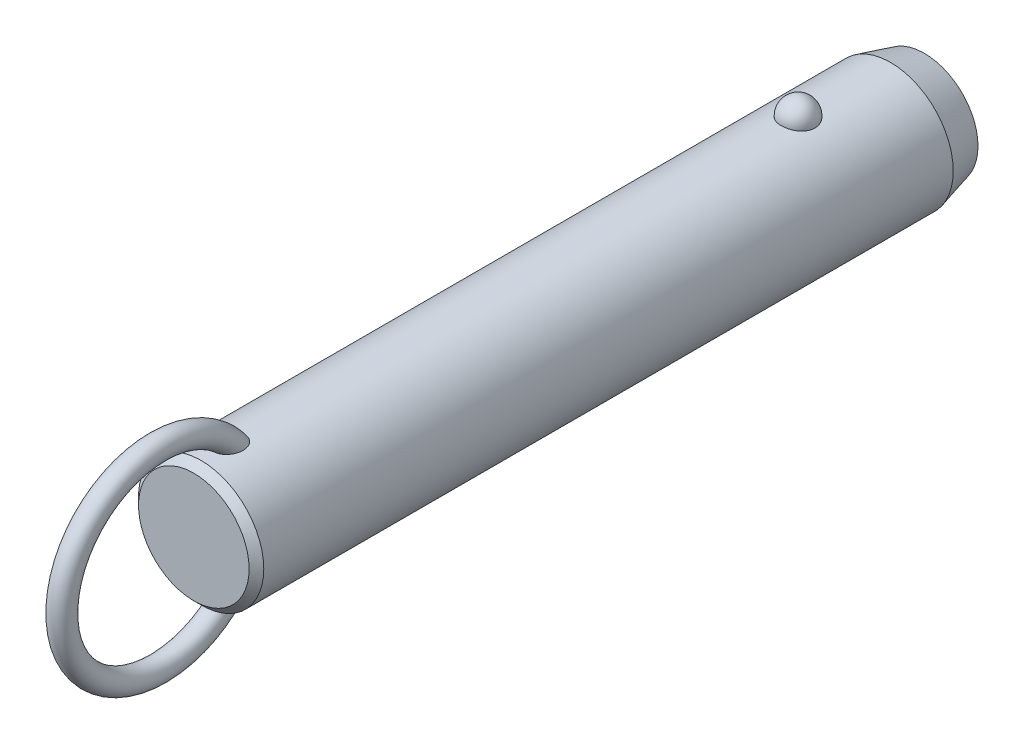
ISO-10303-21;
HEADER;
FILE_DESCRIPTION(('STEP AP214'),'2;1');
FILE_NAME('part.step','',(''),(''),'','','');
FILE_SCHEMA(('AUTOMOTIVE_DESIGN { 1 0 10303 214 1 1 1 1 }'));
ENDSEC;
DATA;
#1=APPLICATION_CONTEXT('core data for automotive mechanical design processes');
#2=APPLICATION_PROTOCOL_DEFINITION('international standard','automotive_design',2000,#1);
#3=PRODUCT_CONTEXT('',#1,'mechanical');
#4=PRODUCT('Part','Part','',(#3));
#5=PRODUCT_RELATED_PRODUCT_CATEGORY('part','',(#4));
#6=PRODUCT_DEFINITION_FORMATION('','',#4);
#7=PRODUCT_DEFINITION_CONTEXT('part definition',#1,'design');
#8=PRODUCT_DEFINITION('design','',#6,#7);
#9=PRODUCT_DEFINITION_SHAPE('','',#8);
#10=(LENGTH_UNIT() NAMED_UNIT(*) SI_UNIT(.MILLI.,.METRE.));
#11=(NAMED_UNIT(*) PLANE_ANGLE_UNIT() SI_UNIT($,.RADIAN.));
#12=(NAMED_UNIT(*) SI_UNIT($,.STERADIAN.) SOLID_ANGLE_UNIT());
#13=UNCERTAINTY_MEASURE_WITH_UNIT(LENGTH_MEASURE(1.E-05),#10,'distance_accuracy_value','');
#14=(GEOMETRIC_REPRESENTATION_CONTEXT(3) GLOBAL_UNCERTAINTY_ASSIGNED_CONTEXT((#13)) GLOBAL_UNIT_ASSIGNED_CONTEXT((#10,
#11,#12)) REPRESENTATION_CONTEXT('',''));
#15=CARTESIAN_POINT('',(0.,0.,0.));
#16=DIRECTION('',(0.,0.,1.));
#17=DIRECTION('',(1.,0.,0.));
#18=AXIS2_PLACEMENT_3D('',#15,#16,#17);
#19=CARTESIAN_POINT('',(0.,0.,91.4));
#20=DIRECTION('',(0.,0.,-1.));
#21=DIRECTION('',(-1.,0.,0.));
#22=AXIS2_PLACEMENT_3D('',#19,#20,#21);
#23=CYLINDRICAL_SURFACE('',#22,11.1);
#24=CARTESIAN_POINT('',(2.9724815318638,10.6945945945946,-3.));
#25=CARTESIAN_POINT('',(2.97247830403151,10.6945972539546,-2.83225059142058));
#26=CARTESIAN_POINT('',(2.95876598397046,10.6984356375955,-2.6644597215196));
#27=CARTESIAN_POINT('',(2.90424529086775,10.7133624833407,-2.33362381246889));
#28=CARTESIAN_POINT('',(2.8634252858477,10.7244540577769,-2.1705808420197));
#29=CARTESIAN_POINT('',(2.75573657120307,10.7526272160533,-1.85396767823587));
#30=CARTESIAN_POINT('',(2.68887937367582,10.7697061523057,-1.70039333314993));
#31=CARTESIAN_POINT('',(2.53079696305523,10.8079438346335,-1.40691598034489));
#32=CARTESIAN_POINT('',(2.43957264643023,10.8291024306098,-1.2670124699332));
#33=CARTESIAN_POINT('',(2.23458150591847,10.8732541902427,-1.00409565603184));
#34=CARTESIAN_POINT('',(2.12071295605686,10.8962553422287,-0.881162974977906));
#35=CARTESIAN_POINT('',(1.87365402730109,10.9414421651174,-0.656352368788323));
#36=CARTESIAN_POINT('',(1.74046358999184,10.9636278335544,-0.554474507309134));
#37=CARTESIAN_POINT('',(1.45872188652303,11.0046495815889,-0.374872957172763));
#38=CARTESIAN_POINT('',(1.31021276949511,11.0234944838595,-0.297085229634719));
#39=CARTESIAN_POINT('',(1.00170030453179,11.0557957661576,-0.16752977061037));
#40=CARTESIAN_POINT('',(0.841698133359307,11.0692526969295,-0.115759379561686));
#41=CARTESIAN_POINT('',(0.517607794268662,11.0890932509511,-0.0403925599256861));
#42=CARTESIAN_POINT('',(0.353633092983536,11.0955916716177,-0.0163383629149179));
#43=CARTESIAN_POINT('',(0.02384202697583,11.1011989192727,0.00445177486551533));
#44=CARTESIAN_POINT('',(-0.141974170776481,11.1003084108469,0.00119017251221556));
#45=CARTESIAN_POINT('',(-0.46840517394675,11.0912990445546,-0.0323233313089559));
#46=CARTESIAN_POINT('',(-0.629059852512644,11.0832767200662,-0.0622147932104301));
#47=CARTESIAN_POINT('',(-0.942937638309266,11.0609962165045,-0.147645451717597));
#48=CARTESIAN_POINT('',(-1.09616062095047,11.0467379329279,-0.203185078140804));
#49=CARTESIAN_POINT('',(-1.39181061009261,11.0134071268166,-0.3387529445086));
#50=CARTESIAN_POINT('',(-1.53417383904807,10.9943086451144,-0.418913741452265));
#51=CARTESIAN_POINT('',(-1.80342160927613,10.9533667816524,-0.601448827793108));
#52=CARTESIAN_POINT('',(-1.9303046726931,10.9315231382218,-0.703825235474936));
#53=CARTESIAN_POINT('',(-2.16747598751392,10.887005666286,-0.930091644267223));
#54=CARTESIAN_POINT('',(-2.27742774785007,10.8643239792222,-1.05433291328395));
#55=CARTESIAN_POINT('',(-2.47517316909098,10.8209886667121,-1.31966633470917));
#56=CARTESIAN_POINT('',(-2.56296538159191,10.8003351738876,-1.46075958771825));
#57=CARTESIAN_POINT('',(-2.71500300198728,10.7631304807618,-1.75753646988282));
#58=CARTESIAN_POINT('',(-2.77898901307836,10.7466250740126,-1.9133588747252));
#59=CARTESIAN_POINT('',(-2.88046189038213,10.7198747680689,-2.2339152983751));
#60=CARTESIAN_POINT('',(-2.91794947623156,10.709629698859,-2.39864907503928));
#61=CARTESIAN_POINT('',(-2.96537819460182,10.6965949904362,-2.73165170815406));
#62=CARTESIAN_POINT('',(-2.97542891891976,10.693775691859,-2.89990378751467));
#63=CARTESIAN_POINT('',(-2.96804271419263,10.6958279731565,-3.235752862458));
#64=CARTESIAN_POINT('',(-2.95060646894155,10.7006993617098,-3.40334987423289));
#65=CARTESIAN_POINT('',(-2.88883358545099,10.71753912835,-3.73233906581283));
#66=CARTESIAN_POINT('',(-2.84462026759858,10.7294749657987,-3.89375610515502));
#67=CARTESIAN_POINT('',(-2.73050447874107,10.7590797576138,-4.20667949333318));
#68=CARTESIAN_POINT('',(-2.66060103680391,10.7767489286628,-4.35818546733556));
#69=CARTESIAN_POINT('',(-2.49642559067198,10.8159599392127,-4.6478542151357));
#70=CARTESIAN_POINT('',(-2.40203047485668,10.8375211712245,-4.78594458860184));
#71=CARTESIAN_POINT('',(-2.19143488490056,10.8820570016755,-5.0441038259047));
#72=CARTESIAN_POINT('',(-2.07523364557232,10.9050316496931,-5.16417205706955));
#73=CARTESIAN_POINT('',(-1.82361254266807,10.9499219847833,-5.38334833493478));
#74=CARTESIAN_POINT('',(-1.68812945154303,10.9718338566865,-5.48238464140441));
#75=CARTESIAN_POINT('',(-1.40191298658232,11.0120611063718,-5.65618873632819));
#76=CARTESIAN_POINT('',(-1.25118062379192,11.0303767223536,-5.73095813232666));
#77=CARTESIAN_POINT('',(-0.94057074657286,11.0611653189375,-5.85334725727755));
#78=CARTESIAN_POINT('',(-0.780821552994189,11.0737044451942,-5.90127578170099));
#79=CARTESIAN_POINT('',(-0.455204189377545,11.0918598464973,-5.96992976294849));
#80=CARTESIAN_POINT('',(-0.289336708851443,11.0974768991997,-5.99065827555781));
#81=CARTESIAN_POINT('',(0.0406846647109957,11.1011307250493,-6.00418773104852));
#82=CARTESIAN_POINT('',(0.204817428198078,11.099299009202,-5.99747318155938));
#83=CARTESIAN_POINT('',(0.529553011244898,11.088551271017,-5.9574031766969));
#84=CARTESIAN_POINT('',(0.690155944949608,11.0796354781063,-5.92404858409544));
#85=CARTESIAN_POINT('',(1.0027760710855,11.0557204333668,-5.83180084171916));
#86=CARTESIAN_POINT('',(1.15482001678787,11.0407414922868,-5.77299291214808));
#87=CARTESIAN_POINT('',(1.44678373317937,11.0062913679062,-5.63147366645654));
#88=CARTESIAN_POINT('',(1.58670279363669,10.9868199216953,-5.54876095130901));
#89=CARTESIAN_POINT('',(1.8527023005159,10.9451315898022,-5.36027644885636));
#90=CARTESIAN_POINT('',(1.97855158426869,10.9228788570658,-5.25418644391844));
#91=CARTESIAN_POINT('',(2.21080872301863,10.8782509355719,-5.02251354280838));
#92=CARTESIAN_POINT('',(2.31721312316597,10.8558757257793,-4.89692718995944));
#93=CARTESIAN_POINT('',(2.5094551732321,10.8130715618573,-4.62745408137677));
#94=CARTESIAN_POINT('',(2.59493284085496,10.7926798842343,-4.48330448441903));
#95=CARTESIAN_POINT('',(2.740862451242,10.7565495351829,-4.18236358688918));
#96=CARTESIAN_POINT('',(2.80132490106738,10.7408089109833,-4.02557762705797));
#97=CARTESIAN_POINT('',(2.88959070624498,10.7173718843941,-3.72475308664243));
#98=CARTESIAN_POINT('',(2.92062102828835,10.7088950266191,-3.58171216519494));
#99=CARTESIAN_POINT('',(2.96206765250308,10.6975052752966,-3.29245795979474));
#100=CARTESIAN_POINT('',(2.97248434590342,10.6945922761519,-3.14624473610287));
#101=CARTESIAN_POINT('',(2.9724815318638,10.6945945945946,-3.));
#102=B_SPLINE_CURVE_WITH_KNOTS('',3,(#24,#25,#26,#27,#28,#29,#30,#31,#32,#33,#34,#35,#36,#37,
#38,#39,#40,#41,#42,#43,#44,#45,#46,#47,#48,#49,#50,#51,#52,#53,#54,#55,#56,#57,#58,#59,#60,#61,
#62,#63,#64,#65,#66,#67,#68,#69,#70,#71,#72,#73,#74,#75,#76,#77,#78,#79,#80,#81,#82,#83,#84,#85,
#86,#87,#88,#89,#90,#91,#92,#93,#94,#95,#96,#97,#98,#99,#100,#101),.UNSPECIFIED.,.T.,.F.,(4,2,2,
2,2,2,2,2,2,2,2,2,2,2,2,2,2,2,2,2,2,2,2,2,2,2,2,2,2,2,2,2,2,2,2,2,2,2,4),(0.,0.502722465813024,
1.00566079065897,1.50837699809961,2.01107471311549,2.51608392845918,3.02109467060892,
3.52475118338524,4.02835620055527,4.523518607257,5.0186364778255,5.50715297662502,
5.9956776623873,6.48688002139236,6.97812923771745,7.47814366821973,7.9781907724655,
8.48353712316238,8.9888697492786,9.49218093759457,9.99547960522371,10.4964777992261,
10.997494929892,11.5010810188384,12.0046847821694,12.5099796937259,13.0152411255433,
13.5145635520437,14.0138298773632,14.5043200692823,14.9947943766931,15.4836390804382,
15.9725123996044,16.4685040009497,16.9645836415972,17.4686765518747,17.972557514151,
18.410841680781,18.849117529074),.UNSPECIFIED.);
#103=CARTESIAN_POINT('',(2.9724815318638,10.6945945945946,-3.));
#104=VERTEX_POINT('',#103);
#105=EDGE_CURVE('E41',#104,#104,#102,.T.);
#106=ORIENTED_EDGE('',*,*,#105,.T.);
#107=EDGE_LOOP('',(#106));
#108=FACE_BOUND('',#107,.T.);
#109=CARTESIAN_POINT('',(0.,0.,102.8));
#110=DIRECTION('',(0.,0.,1.));
#111=DIRECTION('',(1.,0.,0.));
#112=AXIS2_PLACEMENT_3D('',#109,#110,#111);
#113=CIRCLE('',#112,11.1);
#114=CARTESIAN_POINT('',(11.1,0.,102.8));
#115=VERTEX_POINT('',#114);
#116=EDGE_CURVE('E10',#115,#115,#113,.F.);
#117=ORIENTED_EDGE('',*,*,#116,.T.);
#118=EDGE_LOOP('',(#117));
#119=FACE_BOUND('',#118,.T.);
#120=CARTESIAN_POINT('',(-0.564520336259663,-11.0856356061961,95.0578154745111));
#121=CARTESIAN_POINT('',(-0.667202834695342,-11.0804062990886,95.0912839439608));
#122=CARTESIAN_POINT('',(-0.766875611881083,-11.0738877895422,95.1338357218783));
#123=CARTESIAN_POINT('',(-0.957284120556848,-11.0590576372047,95.2354190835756));
#124=CARTESIAN_POINT('',(-1.04801616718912,-11.0507452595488,95.2944574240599));
#125=CARTESIAN_POINT('',(-1.21800952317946,-11.0333016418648,95.4265293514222));
#126=CARTESIAN_POINT('',(-1.29730805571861,-11.0241732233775,95.4995156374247));
#127=CARTESIAN_POINT('',(-1.44337665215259,-11.0060026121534,95.6570374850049));
#128=CARTESIAN_POINT('',(-1.51014622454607,-10.9969604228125,95.7415734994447));
#129=CARTESIAN_POINT('',(-1.63454620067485,-10.9791841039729,95.9255213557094));
#130=CARTESIAN_POINT('',(-1.69127003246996,-10.9705107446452,96.0255493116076));
#131=CARTESIAN_POINT('',(-1.78980785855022,-10.9548648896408,96.2327902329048));
#132=CARTESIAN_POINT('',(-1.83161214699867,-10.9478935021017,96.3400078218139));
#133=CARTESIAN_POINT('',(-1.91557028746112,-10.9335803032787,96.6054080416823));
#134=CARTESIAN_POINT('',(-1.95040620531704,-10.9273269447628,96.7659806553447));
#135=CARTESIAN_POINT('',(-1.99388326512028,-10.9194709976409,97.0906977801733));
#136=CARTESIAN_POINT('',(-2.00248051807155,-10.9178762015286,97.2548478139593));
#137=CARTESIAN_POINT('',(-1.99551615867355,-10.9191578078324,97.6246504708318));
#138=CARTESIAN_POINT('',(-1.9732206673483,-10.9232807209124,97.8301911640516));
#139=CARTESIAN_POINT('',(-1.91529761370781,-10.9335244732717,98.133595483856));
#140=CARTESIAN_POINT('',(-1.8918457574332,-10.9376266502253,98.2340883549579));
#141=CARTESIAN_POINT('',(-1.83700674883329,-10.9469720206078,98.432855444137));
#142=CARTESIAN_POINT('',(-1.80562070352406,-10.9522150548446,98.5311299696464));
#143=CARTESIAN_POINT('',(-1.73463055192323,-10.9636837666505,98.7259148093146));
#144=CARTESIAN_POINT('',(-1.69493416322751,-10.9699202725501,98.8223907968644));
#145=CARTESIAN_POINT('',(-1.6074514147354,-10.9830806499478,99.0116262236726));
#146=CARTESIAN_POINT('',(-1.55966150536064,-10.9900048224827,99.1043840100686));
#147=CARTESIAN_POINT('',(-1.45591812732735,-11.0042280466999,99.2846907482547));
#148=CARTESIAN_POINT('',(-1.40000013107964,-11.0115253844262,99.3722601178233));
#149=CARTESIAN_POINT('',(-1.27937470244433,-11.0261911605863,99.5410298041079));
#150=CARTESIAN_POINT('',(-1.21467835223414,-11.0335594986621,99.6222379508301));
#151=CARTESIAN_POINT('',(-1.08218150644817,-11.0473027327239,99.7690010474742));
#152=CARTESIAN_POINT('',(-1.01522633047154,-11.0537063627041,99.835309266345));
#153=CARTESIAN_POINT('',(-0.872952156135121,-11.065850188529,99.9583780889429));
#154=CARTESIAN_POINT('',(-0.797642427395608,-11.0715911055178,100.015149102));
#155=CARTESIAN_POINT('',(-0.651396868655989,-11.081071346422,100.107515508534));
#156=CARTESIAN_POINT('',(-0.58171263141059,-11.0849841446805,100.145049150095));
#157=CARTESIAN_POINT('',(-0.437066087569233,-11.0916271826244,100.208259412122));
#158=CARTESIAN_POINT('',(-0.362109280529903,-11.0943586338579,100.233948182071));
#159=CARTESIAN_POINT('',(-0.207828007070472,-11.0983242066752,100.271117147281));
#160=CARTESIAN_POINT('',(-0.128467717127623,-11.0995432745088,100.282454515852));
#161=CARTESIAN_POINT('',(0.0309101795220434,-11.1002423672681,100.288965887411));
#162=CARTESIAN_POINT('',(0.110927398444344,-11.0997233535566,100.284148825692));
#163=CARTESIAN_POINT('',(0.256406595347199,-11.097240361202,100.260959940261));
#164=CARTESIAN_POINT('',(0.32223577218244,-11.0955074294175,100.244754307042));
#165=CARTESIAN_POINT('',(0.450635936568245,-11.0910350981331,100.202600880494));
#166=CARTESIAN_POINT('',(0.513205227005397,-11.0882951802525,100.176648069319));
#167=CARTESIAN_POINT('',(0.662626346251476,-11.0805620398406,100.102607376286));
#168=CARTESIAN_POINT('',(0.747127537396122,-11.0751144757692,100.049845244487));
#169=CARTESIAN_POINT('',(0.906756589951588,-11.0631932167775,99.9317206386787));
#170=CARTESIAN_POINT('',(0.981859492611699,-11.0567168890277,99.8663257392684));
#171=CARTESIAN_POINT('',(1.10712207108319,-11.0447856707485,99.7422633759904));
#172=CARTESIAN_POINT('',(1.1590956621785,-11.0394280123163,99.6853831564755));
#173=CARTESIAN_POINT('',(1.25791923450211,-11.0286040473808,99.5673271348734));
#174=CARTESIAN_POINT('',(1.3047664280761,-11.0231376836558,99.5061490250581));
#175=CARTESIAN_POINT('',(1.43818612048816,-11.0068027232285,99.317305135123));
#176=CARTESIAN_POINT('',(1.5175176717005,-10.9960104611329,99.1844531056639));
#177=CARTESIAN_POINT('',(1.63597546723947,-10.9788847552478,98.9531371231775));
#178=CARTESIAN_POINT('',(1.6798887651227,-10.9722190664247,98.8570530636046));
#179=CARTESIAN_POINT('',(1.75953241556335,-10.9597298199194,98.6614311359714));
#180=CARTESIAN_POINT('',(1.79525967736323,-10.9539065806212,98.5618919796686));
#181=CARTESIAN_POINT('',(1.85844731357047,-10.9433632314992,98.3602111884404));
#182=CARTESIAN_POINT('',(1.88591073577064,-10.9386427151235,98.2580705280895));
#183=CARTESIAN_POINT('',(1.9323432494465,-10.9305350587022,98.0518191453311));
#184=CARTESIAN_POINT('',(1.95131065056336,-10.9271481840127,97.9477080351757));
#185=CARTESIAN_POINT('',(1.99040203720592,-10.9201183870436,97.6654588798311));
#186=CARTESIAN_POINT('',(2.00221217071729,-10.9179256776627,97.4860370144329));
#187=CARTESIAN_POINT('',(1.99711676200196,-10.9188636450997,97.1277133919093));
#188=CARTESIAN_POINT('',(1.98026150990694,-10.9219849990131,96.948811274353));
#189=CARTESIAN_POINT('',(1.92151657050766,-10.9324473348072,96.6364514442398));
#190=CARTESIAN_POINT('',(1.88605081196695,-10.9386915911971,96.5017594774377));
#191=CARTESIAN_POINT('',(1.79393020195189,-10.9541780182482,96.2399669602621));
#192=CARTESIAN_POINT('',(1.73729868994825,-10.9634168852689,96.1128582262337));
#193=CARTESIAN_POINT('',(1.61237037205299,-10.9824218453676,95.8894184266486));
#194=CARTESIAN_POINT('',(1.54715374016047,-10.9918945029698,95.7913455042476));
#195=CARTESIAN_POINT('',(1.40127026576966,-11.0114415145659,95.6074341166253));
#196=CARTESIAN_POINT('',(1.32060742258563,-11.0215157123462,95.5215924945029));
#197=CARTESIAN_POINT('',(1.14474787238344,-11.041168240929,95.3651630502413));
#198=CARTESIAN_POINT('',(1.04947805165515,-11.0507437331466,95.2946565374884));
#199=CARTESIAN_POINT('',(0.847278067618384,-11.0680789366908,95.172640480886));
#200=CARTESIAN_POINT('',(0.74035174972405,-11.0758392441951,95.1211246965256));
#201=CARTESIAN_POINT('',(0.52928931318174,-11.0878275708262,95.0434852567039));
#202=CARTESIAN_POINT('',(0.425895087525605,-11.0923259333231,95.0153777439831));
#203=CARTESIAN_POINT('',(0.215723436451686,-11.0984001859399,94.9777038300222));
#204=CARTESIAN_POINT('',(0.108947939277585,-11.0999777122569,94.9681270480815));
#205=CARTESIAN_POINT('',(-0.0938962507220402,-11.1000196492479,94.9678773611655));
#206=CARTESIAN_POINT('',(-0.189967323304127,-11.0987797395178,94.9754089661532));
#207=CARTESIAN_POINT('',(-0.379657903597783,-11.0939111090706,95.0055079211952));
#208=CARTESIAN_POINT('',(-0.473277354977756,-11.0902823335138,95.0280756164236));
#209=CARTESIAN_POINT('',(-0.564520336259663,-11.0856356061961,95.0578154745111));
#210=B_SPLINE_CURVE_WITH_KNOTS('',3,(#120,#121,#122,#123,#124,#125,#126,#127,#128,#129,#130,
#131,#132,#133,#134,#135,#136,#137,#138,#139,#140,#141,#142,#143,#144,#145,#146,#147,#148,#149,
#150,#151,#152,#153,#154,#155,#156,#157,#158,#159,#160,#161,#162,#163,#164,#165,#166,#167,#168,
#169,#170,#171,#172,#173,#174,#175,#176,#177,#178,#179,#180,#181,#182,#183,#184,#185,#186,#187,
#188,#189,#190,#191,#192,#193,#194,#195,#196,#197,#198,#199,#200,#201,#202,#203,#204,#205,#206,
#207,#208,#209),.UNSPECIFIED.,.T.,.F.,(4,2,2,2,2,2,2,2,2,2,2,2,2,2,2,2,2,2,2,2,2,2,2,2,2,2,2,2,
2,2,2,2,2,2,2,2,2,2,2,2,2,2,2,2,4),(0.,0.323999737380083,0.648132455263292,0.971184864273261,
1.29424994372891,1.6388623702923,1.98369857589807,2.47426059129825,2.96564271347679,
3.58257396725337,3.89215258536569,4.20168803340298,4.51486273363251,4.82817514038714,
5.14015911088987,5.45175282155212,5.73442856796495,6.01679375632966,6.25364580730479,
6.49025437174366,6.72919963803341,6.96801276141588,7.17061258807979,7.37331685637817,
7.67094989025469,7.96935728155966,8.20075067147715,8.43226927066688,8.89581623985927,
9.21306533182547,9.53043400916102,9.84768549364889,10.1650000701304,10.70229304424,
11.2386443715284,11.6553390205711,12.0715755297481,12.4245637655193,12.7774607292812,
13.1321855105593,13.4867936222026,13.8068771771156,14.1267813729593,14.4146787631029,
14.7025827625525),.UNSPECIFIED.);
#211=CARTESIAN_POINT('',(-0.564520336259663,-11.0856356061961,95.0578154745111));
#212=VERTEX_POINT('',#211);
#213=EDGE_CURVE('E59',#212,#212,#210,.T.);
#214=ORIENTED_EDGE('',*,*,#213,.T.);
#215=EDGE_LOOP('',(#214));
#216=FACE_BOUND('',#215,.T.);
#217=CARTESIAN_POINT('',(-0.564520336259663,11.0856356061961,95.0578154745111));
#218=CARTESIAN_POINT('',(-0.468542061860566,11.0905203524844,95.0265456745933));
#219=CARTESIAN_POINT('',(-0.36979381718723,11.0942886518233,95.0031576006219));
#220=CARTESIAN_POINT('',(-0.169555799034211,11.0991586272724,94.9730858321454));
#221=CARTESIAN_POINT('',(-0.0680604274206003,11.1002543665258,94.9664393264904));
#222=CARTESIAN_POINT('',(0.134549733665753,11.099646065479,94.9701579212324));
#223=CARTESIAN_POINT('',(0.235664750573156,11.0979441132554,94.9805103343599));
#224=CARTESIAN_POINT('',(0.43463240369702,11.0919342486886,95.0178318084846));
#225=CARTESIAN_POINT('',(0.532486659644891,11.0876276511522,95.0447924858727));
#226=CARTESIAN_POINT('',(0.722445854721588,11.0768742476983,95.1144096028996));
#227=CARTESIAN_POINT('',(0.814543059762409,11.0704246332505,95.1570866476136));
#228=CARTESIAN_POINT('',(0.99056508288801,11.0560659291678,95.2566487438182));
#229=CARTESIAN_POINT('',(1.07448844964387,11.048156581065,95.3135363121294));
#230=CARTESIAN_POINT('',(1.23562672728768,11.0313221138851,95.4422106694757));
#231=CARTESIAN_POINT('',(1.31242684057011,11.0223686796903,95.5145117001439));
#232=CARTESIAN_POINT('',(1.45398030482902,11.0045918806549,95.6700425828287));
#233=CARTESIAN_POINT('',(1.51873073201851,10.9957685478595,95.7532750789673));
#234=CARTESIAN_POINT('',(1.64107232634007,10.9782087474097,95.9363842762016));
#235=CARTESIAN_POINT('',(1.69743176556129,10.9695572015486,96.0370893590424));
#236=CARTESIAN_POINT('',(1.79515063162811,10.9539887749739,96.2456264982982));
#237=CARTESIAN_POINT('',(1.83649966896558,10.9470730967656,96.3534634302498));
#238=CARTESIAN_POINT('',(1.91931148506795,10.9329211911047,96.6203995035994));
#239=CARTESIAN_POINT('',(1.9534010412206,10.9267904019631,96.7818612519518));
#240=CARTESIAN_POINT('',(1.99526195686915,10.9192174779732,97.1082163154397));
#241=CARTESIAN_POINT('',(2.00298989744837,10.9177830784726,97.2731148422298));
#242=CARTESIAN_POINT('',(1.99396251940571,10.9194420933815,97.6441006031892));
#243=CARTESIAN_POINT('',(1.97050829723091,10.923774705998,97.8500387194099));
#244=CARTESIAN_POINT('',(1.91079643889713,10.9343131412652,98.1539019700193));
#245=CARTESIAN_POINT('',(1.88673702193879,10.9385106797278,98.2545296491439));
#246=CARTESIAN_POINT('',(1.83065508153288,10.9480376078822,98.4535107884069));
#247=CARTESIAN_POINT('',(1.79863369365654,10.9533668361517,98.551864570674));
#248=CARTESIAN_POINT('',(1.72633365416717,10.9649954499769,98.746720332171));
#249=CARTESIAN_POINT('',(1.68596409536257,10.9713053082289,98.8431879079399));
#250=CARTESIAN_POINT('',(1.5970799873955,10.9845964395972,99.0323233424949));
#251=CARTESIAN_POINT('',(1.54856169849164,10.9915780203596,99.1249894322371));
#252=CARTESIAN_POINT('',(1.44330168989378,11.0058935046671,99.3049752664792));
#253=CARTESIAN_POINT('',(1.38659749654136,11.0132257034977,99.392316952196));
#254=CARTESIAN_POINT('',(1.26431158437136,11.0279330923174,99.5604563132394));
#255=CARTESIAN_POINT('',(1.19874160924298,11.0353082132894,99.6412624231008));
#256=CARTESIAN_POINT('',(1.06542088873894,11.0489310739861,99.7859856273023));
#257=CARTESIAN_POINT('',(0.998640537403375,11.0552153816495,99.850784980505));
#258=CARTESIAN_POINT('',(0.856896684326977,11.0671032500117,99.9708462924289));
#259=CARTESIAN_POINT('',(0.781942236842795,11.0727075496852,100.026118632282));
#260=CARTESIAN_POINT('',(0.636276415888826,11.081949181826,100.115972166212));
#261=CARTESIAN_POINT('',(0.566755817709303,11.0857572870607,100.152441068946));
#262=CARTESIAN_POINT('',(0.422602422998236,11.0921860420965,100.213533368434));
#263=CARTESIAN_POINT('',(0.347974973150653,11.0948079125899,100.238168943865));
#264=CARTESIAN_POINT('',(0.194593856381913,11.0985608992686,100.273323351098));
#265=CARTESIAN_POINT('',(0.115807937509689,11.0996777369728,100.283706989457));
#266=CARTESIAN_POINT('',(-0.0422499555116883,11.1002003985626,100.288574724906));
#267=CARTESIAN_POINT('',(-0.121521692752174,11.09960699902,100.283066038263));
#268=CARTESIAN_POINT('',(-0.266046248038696,11.0970123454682,100.258827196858));
#269=CARTESIAN_POINT('',(-0.331661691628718,11.0952283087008,100.242135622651));
#270=CARTESIAN_POINT('',(-0.459588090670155,11.0906663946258,100.199111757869));
#271=CARTESIAN_POINT('',(-0.521897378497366,11.0878880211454,100.172774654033));
#272=CARTESIAN_POINT('',(-0.671446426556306,11.0800342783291,100.097513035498));
#273=CARTESIAN_POINT('',(-0.756250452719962,11.0744969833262,100.043818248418));
#274=CARTESIAN_POINT('',(-0.916349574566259,11.0624045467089,99.9238029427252));
#275=CARTESIAN_POINT('',(-0.99161892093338,11.0558467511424,99.8574493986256));
#276=CARTESIAN_POINT('',(-1.11713140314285,11.0437783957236,99.7316335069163));
#277=CARTESIAN_POINT('',(-1.16920539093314,11.0383619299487,99.6739524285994));
#278=CARTESIAN_POINT('',(-1.26817476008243,11.02743010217,99.5542809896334));
#279=CARTESIAN_POINT('',(-1.31506731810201,11.0219146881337,99.4922883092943));
#280=CARTESIAN_POINT('',(-1.40399813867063,11.0109399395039,99.3647843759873));
#281=CARTESIAN_POINT('',(-1.4460286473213,11.0054807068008,99.2992677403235));
#282=CARTESIAN_POINT('',(-1.52538779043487,10.9947621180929,99.1654223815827));
#283=CARTESIAN_POINT('',(-1.56271516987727,10.9895028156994,99.0970929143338));
#284=CARTESIAN_POINT('',(-1.64537943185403,10.9774790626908,98.9332101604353));
#285=CARTESIAN_POINT('',(-1.68879497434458,10.9708503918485,98.8366735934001));
#286=CARTESIAN_POINT('',(-1.76740738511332,10.9584602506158,98.6402369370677));
#287=CARTESIAN_POINT('',(-1.80260120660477,10.95269910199,98.5403356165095));
#288=CARTESIAN_POINT('',(-1.86468657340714,10.9423003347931,98.3379663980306));
#289=CARTESIAN_POINT('',(-1.8915816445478,10.9376622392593,98.2354996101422));
#290=CARTESIAN_POINT('',(-1.93682458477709,10.9297405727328,98.0286429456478));
#291=CARTESIAN_POINT('',(-1.9551708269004,10.9264572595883,97.9242527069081));
#292=CARTESIAN_POINT('',(-1.99232562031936,10.9197647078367,97.6426287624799));
#293=CARTESIAN_POINT('',(-2.00294603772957,10.9177914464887,97.4641857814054));
#294=CARTESIAN_POINT('',(-1.99566675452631,10.9191290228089,97.1079962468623));
#295=CARTESIAN_POINT('',(-1.97781651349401,10.9224306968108,96.9302490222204));
#296=CARTESIAN_POINT('',(-1.91747214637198,10.9331592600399,96.6197921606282));
#297=CARTESIAN_POINT('',(-1.88131022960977,10.9395108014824,96.485825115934));
#298=CARTESIAN_POINT('',(-1.7879038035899,10.9551659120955,96.2255975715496));
#299=CARTESIAN_POINT('',(-1.7306830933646,10.9644661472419,96.0993285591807));
#300=CARTESIAN_POINT('',(-1.60475573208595,10.9835398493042,95.8774156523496));
#301=CARTESIAN_POINT('',(-1.53908879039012,10.9930297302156,95.7800265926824));
#302=CARTESIAN_POINT('',(-1.39238608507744,11.0125708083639,95.5975250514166));
#303=CARTESIAN_POINT('',(-1.31135150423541,11.0226219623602,95.5124116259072));
#304=CARTESIAN_POINT('',(-1.14382035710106,11.0411991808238,95.3652994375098));
#305=CARTESIAN_POINT('',(-1.05858500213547,11.0497792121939,95.3018693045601));
#306=CARTESIAN_POINT('',(-0.878723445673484,11.0655285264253,95.1902505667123));
#307=CARTESIAN_POINT('',(-0.784123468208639,11.0727015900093,95.1420208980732));
#308=CARTESIAN_POINT('',(-0.646163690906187,11.0812501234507,95.086023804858));
#309=CARTESIAN_POINT('',(-0.605595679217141,11.0835451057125,95.0711978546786));
#310=CARTESIAN_POINT('',(-0.564520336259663,11.0856356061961,95.0578154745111));
#311=B_SPLINE_CURVE_WITH_KNOTS('',3,(#217,#218,#219,#220,#221,#222,#223,#224,#225,#226,#227,
#228,#229,#230,#231,#232,#233,#234,#235,#236,#237,#238,#239,#240,#241,#242,#243,#244,#245,#246,
#247,#248,#249,#250,#251,#252,#253,#254,#255,#256,#257,#258,#259,#260,#261,#262,#263,#264,#265,
#266,#267,#268,#269,#270,#271,#272,#273,#274,#275,#276,#277,#278,#279,#280,#281,#282,#283,#284,
#285,#286,#287,#288,#289,#290,#291,#292,#293,#294,#295,#296,#297,#298,#299,#300,#301,#302,#303,
#304,#305,#306,#307,#308,#309,#310),.UNSPECIFIED.,.T.,.F.,(4,2,2,2,2,2,2,2,2,2,2,2,2,2,2,2,2,2,
2,2,2,2,2,2,2,2,2,2,2,2,2,2,2,2,2,2,2,2,2,2,2,2,2,2,2,2,4),(0.,0.303061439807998,
0.606795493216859,0.910302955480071,1.21365733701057,1.51741085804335,1.82121821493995,
2.13745205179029,2.45376252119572,2.79958678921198,3.14564996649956,3.63832391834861,
4.13180893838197,4.75031912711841,5.06071926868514,5.37107516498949,5.68500772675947,
5.99908475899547,6.31176519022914,6.62403542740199,6.90315673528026,7.1819719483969,
7.41687778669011,7.65154134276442,7.88841587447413,8.12518286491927,8.3275284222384,
8.52997509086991,8.82986421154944,9.13054668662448,9.36393502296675,9.59744991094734,
9.83133221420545,10.0652767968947,10.383032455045,10.7009056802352,11.0186436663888,
11.3364420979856,11.8705925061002,12.4038159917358,12.8189662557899,13.2336487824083,
13.5857049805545,13.9377340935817,14.2561354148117,14.5736690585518,14.7033687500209),.UNSPECIFIED.);
#312=CARTESIAN_POINT('',(-0.564520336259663,11.0856356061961,95.0578154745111));
#313=VERTEX_POINT('',#312);
#314=EDGE_CURVE('E66',#313,#313,#311,.T.);
#315=ORIENTED_EDGE('',*,*,#314,.T.);
#316=EDGE_LOOP('',(#315));
#317=FACE_BOUND('',#316,.T.);
#318=CARTESIAN_POINT('',(0.,0.,-19.4000000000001));
#319=DIRECTION('',(0.,0.,-1.));
#320=DIRECTION('',(-1.,0.,0.));
#321=AXIS2_PLACEMENT_3D('',#318,#319,#320);
#322=CIRCLE('',#321,11.1);
#323=CARTESIAN_POINT('',(11.1,0.,-19.4000000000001));
#324=VERTEX_POINT('',#323);
#325=EDGE_CURVE('E56',#324,#324,#322,.F.);
#326=ORIENTED_EDGE('',*,*,#325,.T.);
#327=EDGE_LOOP('',(#326));
#328=FACE_BOUND('',#327,.T.);
#329=ADVANCED_FACE('F37',(#108,#119,#216,#317,#328),#23,.T.);
#330=CARTESIAN_POINT('',(0.,0.,-25.4));
#331=DIRECTION('',(0.,0.,-1.));
#332=DIRECTION('',(-1.,0.,0.));
#333=AXIS2_PLACEMENT_3D('',#330,#331,#332);
#334=PLANE('',#333);
#335=CARTESIAN_POINT('',(0.,0.,-25.4));
#336=DIRECTION('',(0.,0.,-1.));
#337=DIRECTION('',(-1.,0.,0.));
#338=AXIS2_PLACEMENT_3D('',#335,#336,#337);
#339=CIRCLE('',#338,9.49230484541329);
#340=CARTESIAN_POINT('',(9.49230484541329,0.,-25.4));
#341=VERTEX_POINT('',#340);
#342=EDGE_CURVE('E65',#341,#341,#339,.T.);
#343=ORIENTED_EDGE('',*,*,#342,.T.);
#344=EDGE_LOOP('',(#343));
#345=FACE_BOUND('',#344,.T.);
#346=ADVANCED_FACE('F84',(#345),#334,.T.);
#347=CARTESIAN_POINT('',(0.,0.,-25.4));
#348=DIRECTION('',(0.,0.,1.));
#349=DIRECTION('',(1.,0.,0.));
#350=AXIS2_PLACEMENT_3D('',#347,#348,#349);
#351=CONICAL_SURFACE('',#350,9.49230484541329,0.261799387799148);
#352=CARTESIAN_POINT('',(11.1,0.,-19.4000000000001));
#353=CARTESIAN_POINT('',(11.0832531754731,0.,-19.4625000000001));
#354=CARTESIAN_POINT('',(11.0665063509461,0.,-19.5250000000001));
#355=CARTESIAN_POINT('',(11.0330127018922,0.,-19.6500000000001));
#356=CARTESIAN_POINT('',(11.0162658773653,0.,-19.7125));
#357=CARTESIAN_POINT('',(10.9827722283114,0.,-19.8375));
#358=CARTESIAN_POINT('',(10.9660254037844,0.,-19.9));
#359=CARTESIAN_POINT('',(10.9325317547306,0.,-20.025));
#360=CARTESIAN_POINT('',(10.9157849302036,0.,-20.0875));
#361=CARTESIAN_POINT('',(10.8822912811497,0.,-20.2125));
#362=CARTESIAN_POINT('',(10.8655444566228,0.,-20.275));
#363=CARTESIAN_POINT('',(10.8320508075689,0.,-20.4));
#364=CARTESIAN_POINT('',(10.8153039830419,0.,-20.4625));
#365=CARTESIAN_POINT('',(10.781810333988,0.,-20.5875));
#366=CARTESIAN_POINT('',(10.7650635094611,0.,-20.65));
#367=CARTESIAN_POINT('',(10.7315698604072,0.,-20.775));
#368=CARTESIAN_POINT('',(10.7148230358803,0.,-20.8375));
#369=CARTESIAN_POINT('',(10.6813293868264,0.,-20.9625));
#370=CARTESIAN_POINT('',(10.6645825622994,0.,-21.025));
#371=CARTESIAN_POINT('',(10.6310889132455,0.,-21.15));
#372=CARTESIAN_POINT('',(10.6143420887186,0.,-21.2125));
#373=CARTESIAN_POINT('',(10.5808484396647,0.,-21.3375));
#374=CARTESIAN_POINT('',(10.5641016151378,0.,-21.4));
#375=CARTESIAN_POINT('',(10.5306079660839,0.,-21.525));
#376=CARTESIAN_POINT('',(10.5138611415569,0.,-21.5875));
#377=CARTESIAN_POINT('',(10.480367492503,0.,-21.7125));
#378=CARTESIAN_POINT('',(10.4636206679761,0.,-21.775));
#379=CARTESIAN_POINT('',(10.4301270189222,0.,-21.9));
#380=CARTESIAN_POINT('',(10.4133801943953,0.,-21.9625));
#381=CARTESIAN_POINT('',(10.3798865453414,0.,-22.0875));
#382=CARTESIAN_POINT('',(10.3631397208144,0.,-22.15));
#383=CARTESIAN_POINT('',(10.3296460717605,0.,-22.275));
#384=CARTESIAN_POINT('',(10.3128992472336,0.,-22.3375));
#385=CARTESIAN_POINT('',(10.2794055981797,0.,-22.4625));
#386=CARTESIAN_POINT('',(10.2626587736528,0.,-22.525));
#387=CARTESIAN_POINT('',(10.2291651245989,0.,-22.65));
#388=CARTESIAN_POINT('',(10.2124183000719,0.,-22.7125));
#389=CARTESIAN_POINT('',(10.178924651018,0.,-22.8375));
#390=CARTESIAN_POINT('',(10.1621778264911,0.,-22.9));
#391=CARTESIAN_POINT('',(10.1286841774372,0.,-23.025));
#392=CARTESIAN_POINT('',(10.1119373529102,0.,-23.0875));
#393=CARTESIAN_POINT('',(10.0784437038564,0.,-23.2125));
#394=CARTESIAN_POINT('',(10.0616968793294,0.,-23.275));
#395=CARTESIAN_POINT('',(10.0282032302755,0.,-23.4));
#396=CARTESIAN_POINT('',(10.0114564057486,0.,-23.4625));
#397=CARTESIAN_POINT('',(9.97796275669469,0.,-23.5875));
#398=CARTESIAN_POINT('',(9.96121593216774,0.,-23.65));
#399=CARTESIAN_POINT('',(9.92772228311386,0.,-23.775));
#400=CARTESIAN_POINT('',(9.91097545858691,0.,-23.8375));
#401=CARTESIAN_POINT('',(9.87748180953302,0.,-23.9625));
#402=CARTESIAN_POINT('',(9.86073498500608,0.,-24.025));
#403=CARTESIAN_POINT('',(9.82724133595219,0.,-24.15));
#404=CARTESIAN_POINT('',(9.81049451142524,0.,-24.2125));
#405=CARTESIAN_POINT('',(9.77700086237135,0.,-24.3375));
#406=CARTESIAN_POINT('',(9.76025403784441,0.,-24.4));
#407=CARTESIAN_POINT('',(9.72676038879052,0.,-24.525));
#408=CARTESIAN_POINT('',(9.71001356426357,0.,-24.5875));
#409=CARTESIAN_POINT('',(9.67651991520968,0.,-24.7125));
#410=CARTESIAN_POINT('',(9.65977309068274,0.,-24.775));
#411=CARTESIAN_POINT('',(9.62627944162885,0.,-24.9));
#412=CARTESIAN_POINT('',(9.6095326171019,0.,-24.9625));
#413=CARTESIAN_POINT('',(9.57603896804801,0.,-25.0875));
#414=CARTESIAN_POINT('',(9.55929214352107,0.,-25.15));
#415=CARTESIAN_POINT('',(9.52579849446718,0.,-25.275));
#416=CARTESIAN_POINT('',(9.50905166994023,0.,-25.3375));
#417=CARTESIAN_POINT('',(9.49230484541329,0.,-25.4));
#418=B_SPLINE_CURVE_WITH_KNOTS('',3,(#352,#353,#354,#355,#356,#357,#358,#359,#360,#361,#362,
#363,#364,#365,#366,#367,#368,#369,#370,#371,#372,#373,#374,#375,#376,#377,#378,#379,#380,#381,
#382,#383,#384,#385,#386,#387,#388,#389,#390,#391,#392,#393,#394,#395,#396,#397,#398,#399,#400,
#401,#402,#403,#404,#405,#406,#407,#408,#409,#410,#411,#412,#413,#414,#415,#416,#417),
.UNSPECIFIED.,.F.,.F.,(4,2,2,2,2,2,2,2,2,2,2,2,2,2,2,2,2,2,2,2,2,2,2,2,2,2,2,2,2,2,2,2,4),(0.,
0.194114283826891,0.388228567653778,0.582342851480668,0.776457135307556,0.970571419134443,
1.16468570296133,1.35879998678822,1.55291427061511,1.747028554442,1.94114283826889,
2.13525712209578,2.32937140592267,2.52348568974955,2.71759997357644,2.91171425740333,
3.10582854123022,3.29994282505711,3.494057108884,3.68817139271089,3.88228567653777,
4.07639996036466,4.27051424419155,4.46462852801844,4.65874281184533,4.85285709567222,
5.04697137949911,5.24108566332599,5.43519994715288,5.62931423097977,5.82342851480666,
6.01754279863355,6.21165708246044),.UNSPECIFIED.);
#419=EDGE_CURVE('BSEAM82',#324,#341,#418,.T.);
#420=ORIENTED_EDGE('',*,*,#325,.F.);
#421=ORIENTED_EDGE('',*,*,#342,.F.);
#422=ORIENTED_EDGE('',*,*,#419,.T.);
#423=ORIENTED_EDGE('',*,*,#419,.F.);
#424=EDGE_LOOP('',(#420,#422,#421,#423));
#425=FACE_BOUND('',#424,.T.);
#426=ADVANCED_FACE('F82',(#425),#351,.T.);
#427=CARTESIAN_POINT('',(0.,0.,104.1));
#428=DIRECTION('',(0.,0.,1.));
#429=DIRECTION('',(1.,0.,0.));
#430=AXIS2_PLACEMENT_3D('',#427,#428,#429);
#431=PLANE('',#430);
#432=CARTESIAN_POINT('',(0.,0.,104.1));
#433=DIRECTION('',(0.,0.,1.));
#434=DIRECTION('',(1.,0.,0.));
#435=AXIS2_PLACEMENT_3D('',#432,#433,#434);
#436=CIRCLE('',#435,9.80000000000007);
#437=CARTESIAN_POINT('',(9.80000000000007,0.,104.1));
#438=VERTEX_POINT('',#437);
#439=EDGE_CURVE('E50',#438,#438,#436,.T.);
#440=ORIENTED_EDGE('',*,*,#439,.T.);
#441=EDGE_LOOP('',(#440));
#442=FACE_BOUND('',#441,.T.);
#443=ADVANCED_FACE('F76',(#442),#431,.T.);
#444=CARTESIAN_POINT('',(0.,0.,110.45));
#445=DIRECTION('',(1.,0.,0.));
#446=DIRECTION('',(0.,0.,-1.));
#447=AXIS2_PLACEMENT_3D('',#444,#445,#446);
#448=TOROIDAL_SURFACE('',#447,17.05,2.);
#449=ORIENTED_EDGE('',*,*,#314,.F.);
#450=EDGE_LOOP('',(#449));
#451=FACE_BOUND('',#450,.T.);
#452=ORIENTED_EDGE('',*,*,#213,.F.);
#453=EDGE_LOOP('',(#452));
#454=FACE_BOUND('',#453,.T.);
#455=ADVANCED_FACE('F72',(#451,#454),#448,.T.);
#456=CARTESIAN_POINT('',(0.,0.,104.1));
#457=DIRECTION('',(0.,0.,-1.));
#458=DIRECTION('',(-1.,0.,0.));
#459=AXIS2_PLACEMENT_3D('',#456,#457,#458);
#460=CONICAL_SURFACE('',#459,9.80000000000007,0.78539816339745);
#461=ORIENTED_EDGE('',*,*,#116,.F.);
#462=EDGE_LOOP('',(#461));
#463=FACE_BOUND('',#462,.T.);
#464=ORIENTED_EDGE('',*,*,#439,.F.);
#465=EDGE_LOOP('',(#464));
#466=FACE_BOUND('',#465,.T.);
#467=ADVANCED_FACE('F39',(#463,#466),#460,.T.);
#468=CARTESIAN_POINT('',(0.,11.1,-3.));
#469=DIRECTION('',(0.,1.,0.));
#470=DIRECTION('',(0.,0.,-1.));
#471=AXIS2_PLACEMENT_3D('',#468,#469,#470);
#472=SPHERICAL_SURFACE('',#471,3.);
#473=ORIENTED_EDGE('',*,*,#105,.F.);
#474=EDGE_LOOP('',(#473));
#475=FACE_BOUND('',#474,.T.);
#476=ADVANCED_FACE('F78',(#475),#472,.T.);
#477=CLOSED_SHELL('',(#329,#346,#426,#443,#455,#467,#476));
#478=MANIFOLD_SOLID_BREP('B2',#477);
#479=ADVANCED_BREP_SHAPE_REPRESENTATION('',(#18,#478),#14);
#480=SHAPE_DEFINITION_REPRESENTATION(#9,#479);
ENDSEC;
END-ISO-10303-21;
